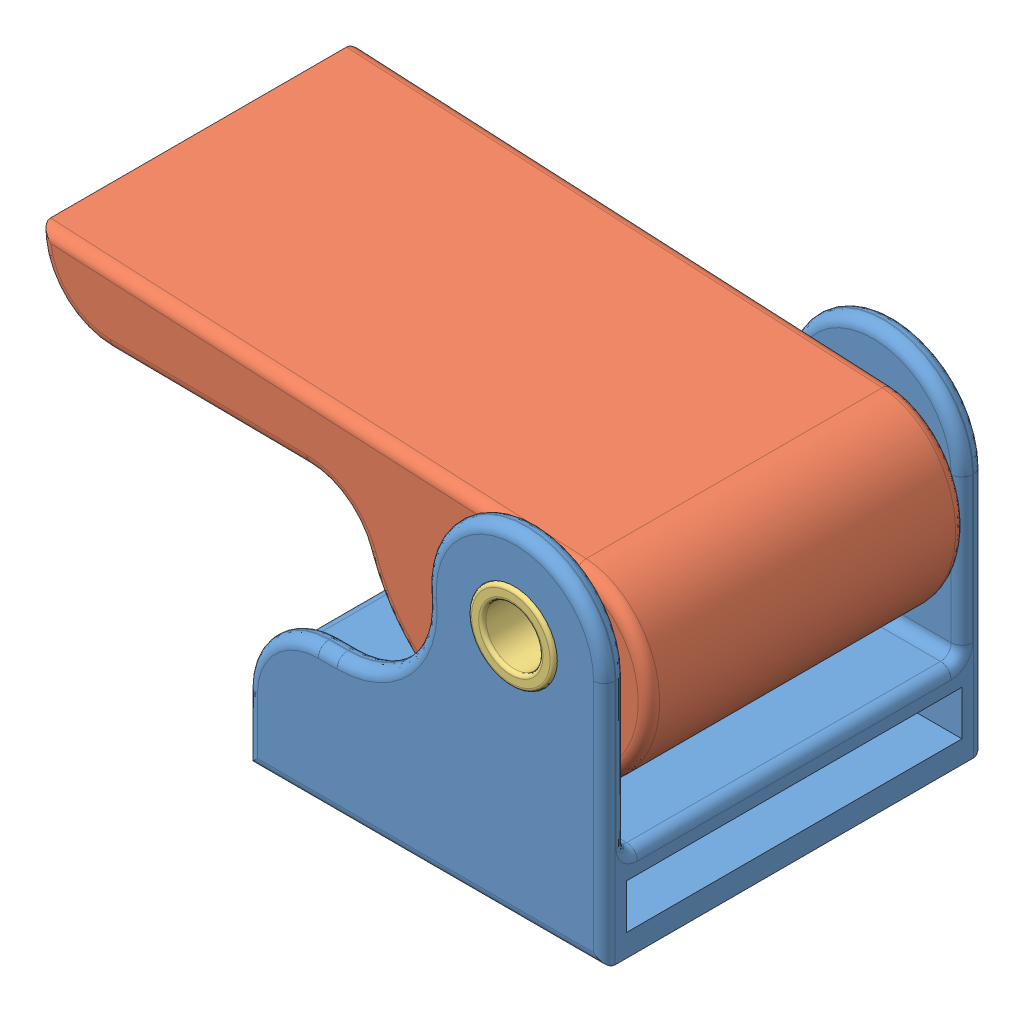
SolidWorks assembly Clasp assembly.SLDASM, configuration Default (file format 4700). Lengths in mm.
Overall size (47.96 32.78 27.57).
3 component instances, 3 part files, 4 mates.
Components (placement in the parent):
- Clasp-1-1: Clasp-1.SLDPRT [Default] at origin size (25.4 23.81 26.99)
- Clasp-2a-1: Clasp-2a.SLDPRT [Default] at (-6.35 12.7 0) x (0.961736 -0.273977 0) z (0 0 1) size (44.97 17.22 22.68)
- Clasp-pin-1: Clasp-pin.SLDPRT [Default] at (-6.35 12.7 0) x (0 0 1) z (-1 0 0) size (27.57 6.1 6.1)
Mates (geometry in assembly coordinates):
- Concentric2: concentric aligned: cylinder of Clasp-1-1 through (-6.35 12.7 -13.4938) axis (0 0 1) radius 2.3876; cylinder of Clasp-2a-1 through (-6.35 12.7 -11.2713) axis (0 0 1) radius 2.3876
- Coincident2: coincident aligned: plane of Clasp-1-1; plane of Clasp-2a-1
- Concentric3: concentric anti-aligned: cylinder of Clasp-2a-1 through (-6.35 12.7 -11.2713) axis (0 0 1) radius 2.3876; cylinder of Clasp-pin-1 through (-6.35 12.7 13.5319) axis (0 0 -1) radius 2.286
- Coincident3: coincident aligned: plane of Clasp-2a-1; plane of Clasp-pin-1
